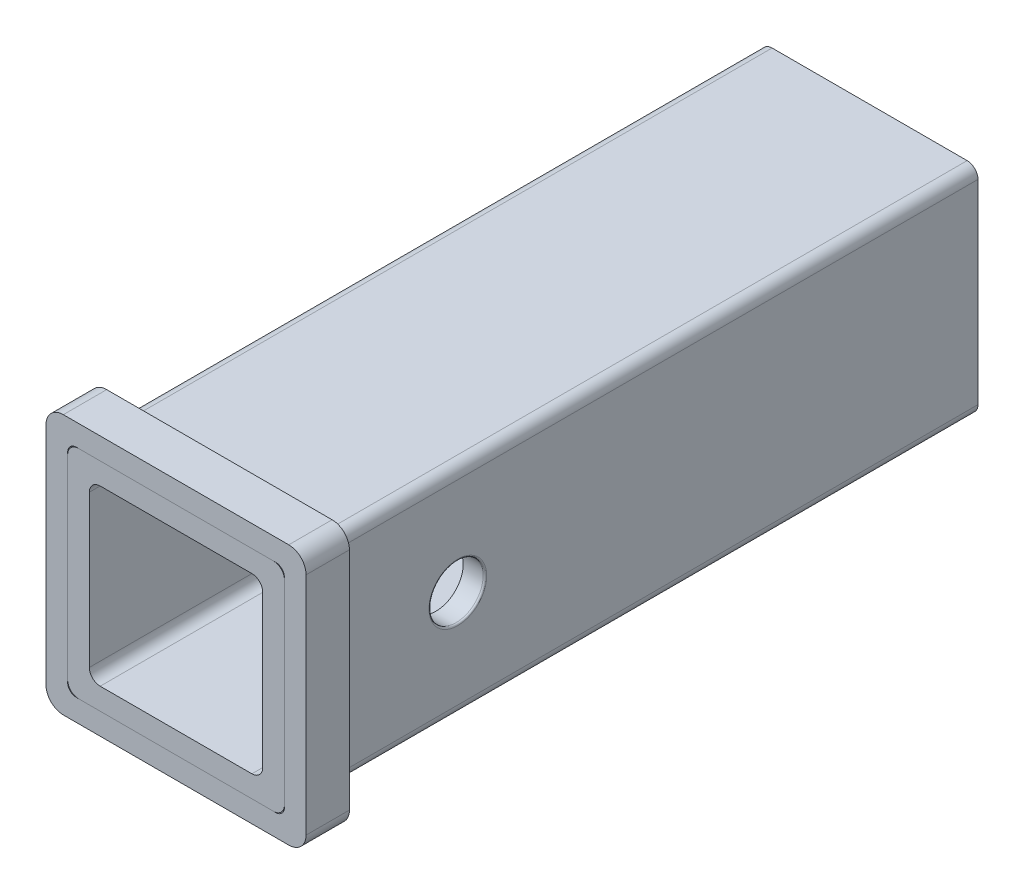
from build123d import *

# Parameters (mm, degrees)
SKETCH3_W               = 63.5
SKETCH3_H               = 63.5
SKETCH3_W_2             = 50.8
SKETCH3_H_2             = 50.8
BOSS_EXTRUDE1_DEPTH     = 203.2
FILLET1_R               = 3.175
SKETCH4_W               = 76.2
SKETCH4_H               = 76.2
SKETCH4_W_2             = 63.5
SKETCH4_H_2             = 63.5
BOSS_EXTRUDE2_DEPTH     = 12.7
FILLET2_R               = 5.08
FILLET3_R               = 2.54
CUT_EXTRUDE1_DEPTH      = 211.222406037
CUT_EXTRUDE1_DEPTH_BACK = 211.222406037
SKETCH5_R               = 7.9375
FILLET4_R               = 0.508


with BuildPart() as part:
    # Sketch3 → Boss-Extrude1 (new body)
    with BuildSketch(Plane.XY):
        Rectangle(SKETCH3_W, SKETCH3_H)
        Rectangle(SKETCH3_W_2, SKETCH3_H_2, mode=Mode.SUBTRACT)
    extrude(amount=-BOSS_EXTRUDE1_DEPTH)

    # Fillet1
    fillet1_edges = [part.edges().sort_by_distance(p)[0] for p in [
        (-25.4, -25.4, -101.6),
        (-25.4, 25.4, -101.6),
        (25.4, 25.4, -101.6),
        (25.4, -25.4, -101.6),
        (-31.75, 31.75, -101.6),
        (31.75, 31.75, -101.6),
        (31.75, -31.75, -101.6),
        (-31.75, -31.75, -101.6),
    ]]
    fillet(fillet1_edges, radius=FILLET1_R)

    # Sketch5 → Cut-Extrude1 (cut, two sides: drawn at the far end of the back side and taken through both)
    with BuildSketch(Plane(origin=(0, 0, 0), x_dir=(0, 0, -1), z_dir=(1, 0, 0)).offset(-CUT_EXTRUDE1_DEPTH_BACK)):
        with Locations((50.8, 0)):
            Circle(SKETCH5_R)
    extrude(amount=CUT_EXTRUDE1_DEPTH + CUT_EXTRUDE1_DEPTH_BACK, mode=Mode.SUBTRACT)

    # Fillet4
    fillet4_edges = [part.edges().sort_by_distance(p)[0] for p in [
        (-31.75, 0, -42.8625),
        (31.75, 0, -42.8625),
    ]]
    fillet(fillet4_edges, radius=FILLET4_R)


with BuildPart() as body_2:
    # Sketch4 → Boss-Extrude2 (new body)
    with BuildSketch(Plane.XY):
        Rectangle(SKETCH4_W, SKETCH4_H)
        Rectangle(SKETCH4_W_2, SKETCH4_H_2, mode=Mode.SUBTRACT)
    extrude(amount=-BOSS_EXTRUDE2_DEPTH)

    # Fillet2
    fillet2_edges = [body_2.edges().sort_by_distance(p)[0] for p in [
        (38.1, -38.1, -6.35),
        (-38.1, -38.1, -6.35),
        (-38.1, 38.1, -6.35),
        (38.1, 38.1, -6.35),
    ]]
    fillet(fillet2_edges, radius=FILLET2_R)

    # Fillet3
    fillet3_edges = [body_2.edges().sort_by_distance(p)[0] for p in [
        (-31.75, -31.75, -6.35),
        (-31.75, 31.75, -6.35),
        (31.75, 31.75, -6.35),
        (31.75, -31.75, -6.35),
    ]]
    fillet(fillet3_edges, radius=FILLET3_R)


solid = Compound([part.part, body_2.part])
